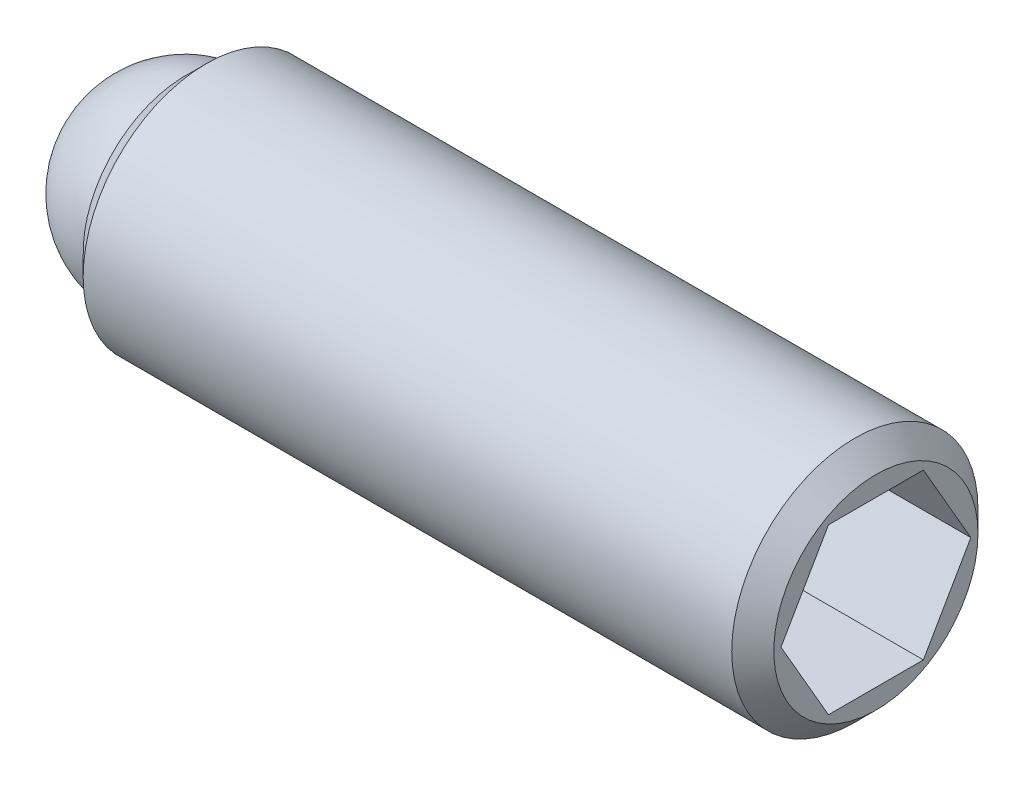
ISO-10303-21;
HEADER;
FILE_DESCRIPTION(('STEP AP214'),'2;1');
FILE_NAME('part.step','',(''),(''),'','','');
FILE_SCHEMA(('AUTOMOTIVE_DESIGN { 1 0 10303 214 1 1 1 1 }'));
ENDSEC;
DATA;
#1=APPLICATION_CONTEXT('core data for automotive mechanical design processes');
#2=APPLICATION_PROTOCOL_DEFINITION('international standard','automotive_design',2000,#1);
#3=PRODUCT_CONTEXT('',#1,'mechanical');
#4=PRODUCT('Part','Part','',(#3));
#5=PRODUCT_RELATED_PRODUCT_CATEGORY('part','',(#4));
#6=PRODUCT_DEFINITION_FORMATION('','',#4);
#7=PRODUCT_DEFINITION_CONTEXT('part definition',#1,'design');
#8=PRODUCT_DEFINITION('design','',#6,#7);
#9=PRODUCT_DEFINITION_SHAPE('','',#8);
#10=(LENGTH_UNIT() NAMED_UNIT(*) SI_UNIT(.MILLI.,.METRE.));
#11=(NAMED_UNIT(*) PLANE_ANGLE_UNIT() SI_UNIT($,.RADIAN.));
#12=(NAMED_UNIT(*) SI_UNIT($,.STERADIAN.) SOLID_ANGLE_UNIT());
#13=UNCERTAINTY_MEASURE_WITH_UNIT(LENGTH_MEASURE(1.E-05),#10,'distance_accuracy_value','');
#14=(GEOMETRIC_REPRESENTATION_CONTEXT(3) GLOBAL_UNCERTAINTY_ASSIGNED_CONTEXT((#13)) GLOBAL_UNIT_ASSIGNED_CONTEXT((#10,
#11,#12)) REPRESENTATION_CONTEXT('',''));
#15=CARTESIAN_POINT('',(0.,0.,0.));
#16=DIRECTION('',(0.,0.,1.));
#17=DIRECTION('',(1.,0.,0.));
#18=AXIS2_PLACEMENT_3D('',#15,#16,#17);
#19=CARTESIAN_POINT('',(0.,0.,0.));
#20=DIRECTION('',(0.,-1.,0.));
#21=DIRECTION('',(0.,0.,-1.));
#22=AXIS2_PLACEMENT_3D('',#19,#20,#21);
#23=SPHERICAL_SURFACE('',#22,1.190625);
#24=CARTESIAN_POINT('',(0.,-1.190625,0.));
#25=VERTEX_POINT('',#24);
#26=VERTEX_LOOP('',#25);
#27=FACE_BOUND('',#26,.T.);
#28=ADVANCED_FACE('F43',(#27),#23,.T.);
#29=CLOSED_SHELL('',(#28));
#30=MANIFOLD_SOLID_BREP('B2',#29);
#31=CARTESIAN_POINT('',(8.334375,0.,0.));
#32=DIRECTION('',(-1.,0.,0.));
#33=DIRECTION('',(0.,0.,1.));
#34=AXIS2_PLACEMENT_3D('',#31,#32,#33);
#35=CYLINDRICAL_SURFACE('',#34,1.4859);
#36=CARTESIAN_POINT('',(8.080375,0.,0.));
#37=DIRECTION('',(1.,0.,0.));
#38=DIRECTION('',(0.,0.,-1.));
#39=AXIS2_PLACEMENT_3D('',#36,#37,#38);
#40=CIRCLE('',#39,1.4859);
#41=CARTESIAN_POINT('',(8.080375,0.,-1.4859));
#42=VERTEX_POINT('',#41);
#43=EDGE_CURVE('E41',#42,#42,#40,.F.);
#44=ORIENTED_EDGE('',*,*,#43,.T.);
#45=EDGE_LOOP('',(#44));
#46=FACE_BOUND('',#45,.T.);
#47=CARTESIAN_POINT('',(0.254000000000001,0.,0.));
#48=DIRECTION('',(1.,0.,0.));
#49=DIRECTION('',(0.,0.,-1.));
#50=AXIS2_PLACEMENT_3D('',#47,#48,#49);
#51=CIRCLE('',#50,1.4859);
#52=CARTESIAN_POINT('',(0.254000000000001,0.,-1.4859));
#53=VERTEX_POINT('',#52);
#54=EDGE_CURVE('E159',#53,#53,#51,.T.);
#55=ORIENTED_EDGE('',*,*,#54,.T.);
#56=EDGE_LOOP('',(#55));
#57=FACE_BOUND('',#56,.T.);
#58=ADVANCED_FACE('F56',(#46,#57),#35,.T.);
#59=CARTESIAN_POINT('',(8.334375,0.,0.));
#60=DIRECTION('',(1.,0.,0.));
#61=DIRECTION('',(0.,0.,-1.));
#62=AXIS2_PLACEMENT_3D('',#59,#60,#61);
#63=PLANE('',#62);
#64=DIRECTION('',(0.,0.866025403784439,-0.5));
#65=VECTOR('',#64,1.);
#66=CARTESIAN_POINT('',(8.334375,-0.992187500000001,-0.572839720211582));
#67=LINE('',#66,#65);
#68=CARTESIAN_POINT('',(8.334375,-0.992187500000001,-0.572839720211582));
#69=VERTEX_POINT('',#68);
#70=CARTESIAN_POINT('',(8.334375,0.,-1.14567944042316));
#71=VERTEX_POINT('',#70);
#72=EDGE_CURVE('E71',#69,#71,#67,.T.);
#73=ORIENTED_EDGE('',*,*,#72,.F.);
#74=DIRECTION('',(0.,0.,-1.));
#75=VECTOR('',#74,1.);
#76=CARTESIAN_POINT('',(8.334375,-0.992187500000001,0.572839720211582));
#77=LINE('',#76,#75);
#78=CARTESIAN_POINT('',(8.334375,-0.992187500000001,0.572839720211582));
#79=VERTEX_POINT('',#78);
#80=EDGE_CURVE('E155',#79,#69,#77,.T.);
#81=ORIENTED_EDGE('',*,*,#80,.F.);
#82=DIRECTION('',(0.,-0.866025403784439,-0.5));
#83=VECTOR('',#82,1.);
#84=CARTESIAN_POINT('',(8.334375,0.,1.14567944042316));
#85=LINE('',#84,#83);
#86=CARTESIAN_POINT('',(8.334375,0.,1.14567944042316));
#87=VERTEX_POINT('',#86);
#88=EDGE_CURVE('E153',#87,#79,#85,.T.);
#89=ORIENTED_EDGE('',*,*,#88,.F.);
#90=DIRECTION('',(0.,-0.866025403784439,0.5));
#91=VECTOR('',#90,1.);
#92=CARTESIAN_POINT('',(8.334375,0.992187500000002,0.572839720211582));
#93=LINE('',#92,#91);
#94=CARTESIAN_POINT('',(8.334375,0.992187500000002,0.572839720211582));
#95=VERTEX_POINT('',#94);
#96=EDGE_CURVE('E119',#95,#87,#93,.T.);
#97=ORIENTED_EDGE('',*,*,#96,.F.);
#98=DIRECTION('',(0.,0.,1.));
#99=VECTOR('',#98,1.);
#100=CARTESIAN_POINT('',(8.334375,0.992187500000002,-0.572839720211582));
#101=LINE('',#100,#99);
#102=CARTESIAN_POINT('',(8.334375,0.992187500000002,-0.572839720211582));
#103=VERTEX_POINT('',#102);
#104=EDGE_CURVE('E149',#103,#95,#101,.T.);
#105=ORIENTED_EDGE('',*,*,#104,.F.);
#106=DIRECTION('',(0.,0.866025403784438,0.5));
#107=VECTOR('',#106,1.);
#108=CARTESIAN_POINT('',(8.334375,0.,-1.14567944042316));
#109=LINE('',#108,#107);
#110=EDGE_CURVE('E145',#71,#103,#109,.T.);
#111=ORIENTED_EDGE('',*,*,#110,.F.);
#112=EDGE_LOOP('',(#73,#81,#89,#97,#105,#111));
#113=FACE_BOUND('',#112,.T.);
#114=CARTESIAN_POINT('',(8.334375,0.,0.));
#115=DIRECTION('',(1.,0.,0.));
#116=DIRECTION('',(0.,0.,-1.));
#117=AXIS2_PLACEMENT_3D('',#114,#115,#116);
#118=CIRCLE('',#117,1.2319);
#119=CARTESIAN_POINT('',(8.334375,0.,-1.2319));
#120=VERTEX_POINT('',#119);
#121=EDGE_CURVE('E64',#120,#120,#118,.T.);
#122=ORIENTED_EDGE('',*,*,#121,.T.);
#123=EDGE_LOOP('',(#122));
#124=FACE_BOUND('',#123,.T.);
#125=ADVANCED_FACE('F172',(#113,#124),#63,.T.);
#126=CARTESIAN_POINT('',(0.,0.,0.));
#127=DIRECTION('',(1.,0.,0.));
#128=DIRECTION('',(0.,0.,-1.));
#129=AXIS2_PLACEMENT_3D('',#126,#127,#128);
#130=PLANE('',#129);
#131=CARTESIAN_POINT('',(0.,0.,0.));
#132=DIRECTION('',(-1.,0.,0.));
#133=DIRECTION('',(0.,0.,1.));
#134=AXIS2_PLACEMENT_3D('',#131,#132,#133);
#135=CIRCLE('',#134,1.190625);
#136=CARTESIAN_POINT('',(0.,0.,1.190625));
#137=VERTEX_POINT('',#136);
#138=EDGE_CURVE('E227',#137,#137,#135,.T.);
#139=ORIENTED_EDGE('',*,*,#138,.F.);
#140=EDGE_LOOP('',(#139));
#141=FACE_BOUND('',#140,.T.);
#142=CARTESIAN_POINT('',(0.,0.,0.));
#143=DIRECTION('',(1.,0.,0.));
#144=DIRECTION('',(0.,0.,-1.));
#145=AXIS2_PLACEMENT_3D('',#142,#143,#144);
#146=CIRCLE('',#145,1.2319);
#147=CARTESIAN_POINT('',(0.,0.,-1.2319));
#148=VERTEX_POINT('',#147);
#149=EDGE_CURVE('E167',#148,#148,#146,.F.);
#150=ORIENTED_EDGE('',*,*,#149,.T.);
#151=EDGE_LOOP('',(#150));
#152=FACE_BOUND('',#151,.T.);
#153=ADVANCED_FACE('F184',(#141,#152),#130,.F.);
#154=CARTESIAN_POINT('',(0.254000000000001,0.,0.));
#155=DIRECTION('',(1.,0.,0.));
#156=DIRECTION('',(0.,0.,-1.));
#157=AXIS2_PLACEMENT_3D('',#154,#155,#156);
#158=CONICAL_SURFACE('',#157,1.4859,0.785398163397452);
#159=ORIENTED_EDGE('',*,*,#149,.F.);
#160=EDGE_LOOP('',(#159));
#161=FACE_BOUND('',#160,.T.);
#162=ORIENTED_EDGE('',*,*,#54,.F.);
#163=EDGE_LOOP('',(#162));
#164=FACE_BOUND('',#163,.T.);
#165=ADVANCED_FACE('F176',(#161,#164),#158,.T.);
#166=CARTESIAN_POINT('',(8.334375,0.,0.));
#167=DIRECTION('',(-1.,0.,0.));
#168=DIRECTION('',(0.,0.,1.));
#169=AXIS2_PLACEMENT_3D('',#166,#167,#168);
#170=CONICAL_SURFACE('',#169,1.2319,0.785398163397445);
#171=ORIENTED_EDGE('',*,*,#43,.F.);
#172=EDGE_LOOP('',(#171));
#173=FACE_BOUND('',#172,.T.);
#174=ORIENTED_EDGE('',*,*,#121,.F.);
#175=EDGE_LOOP('',(#174));
#176=FACE_BOUND('',#175,.T.);
#177=ADVANCED_FACE('F58',(#173,#176),#170,.T.);
#178=CARTESIAN_POINT('',(6.048375,-0.992187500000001,-0.572839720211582));
#179=DIRECTION('',(0.,-0.5,-0.866025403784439));
#180=DIRECTION('',(0.,0.866025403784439,-0.5));
#181=AXIS2_PLACEMENT_3D('',#178,#179,#180);
#182=PLANE('',#181);
#183=ORIENTED_EDGE('',*,*,#72,.T.);
#184=DIRECTION('',(1.,0.,0.));
#185=VECTOR('',#184,1.);
#186=CARTESIAN_POINT('',(6.048375,0.,-1.14567944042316));
#187=LINE('',#186,#185);
#188=CARTESIAN_POINT('',(6.048375,0.,-1.14567944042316));
#189=VERTEX_POINT('',#188);
#190=EDGE_CURVE('E101',#189,#71,#187,.T.);
#191=ORIENTED_EDGE('',*,*,#190,.F.);
#192=DIRECTION('',(0.,0.866025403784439,-0.5));
#193=VECTOR('',#192,1.);
#194=CARTESIAN_POINT('',(6.048375,-0.992187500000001,-0.572839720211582));
#195=LINE('',#194,#193);
#196=CARTESIAN_POINT('',(6.048375,-0.992187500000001,-0.572839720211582));
#197=VERTEX_POINT('',#196);
#198=EDGE_CURVE('E157',#197,#189,#195,.T.);
#199=ORIENTED_EDGE('',*,*,#198,.F.);
#200=DIRECTION('',(1.,0.,0.));
#201=VECTOR('',#200,1.);
#202=CARTESIAN_POINT('',(6.048375,-0.992187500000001,-0.572839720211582));
#203=LINE('',#202,#201);
#204=EDGE_CURVE('E79',#197,#69,#203,.T.);
#205=ORIENTED_EDGE('',*,*,#204,.T.);
#206=EDGE_LOOP('',(#183,#191,#199,#205));
#207=FACE_BOUND('',#206,.T.);
#208=ADVANCED_FACE('F175',(#207),#182,.F.);
#209=CARTESIAN_POINT('',(6.048375,-0.992187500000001,0.572839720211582));
#210=DIRECTION('',(0.,-1.,0.));
#211=DIRECTION('',(0.,0.,-1.));
#212=AXIS2_PLACEMENT_3D('',#209,#210,#211);
#213=PLANE('',#212);
#214=ORIENTED_EDGE('',*,*,#80,.T.);
#215=ORIENTED_EDGE('',*,*,#204,.F.);
#216=DIRECTION('',(0.,0.,-1.));
#217=VECTOR('',#216,1.);
#218=CARTESIAN_POINT('',(6.048375,-0.992187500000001,0.572839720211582));
#219=LINE('',#218,#217);
#220=CARTESIAN_POINT('',(6.048375,-0.992187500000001,0.572839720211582));
#221=VERTEX_POINT('',#220);
#222=EDGE_CURVE('E131',#221,#197,#219,.T.);
#223=ORIENTED_EDGE('',*,*,#222,.F.);
#224=DIRECTION('',(1.,0.,0.));
#225=VECTOR('',#224,1.);
#226=CARTESIAN_POINT('',(6.048375,-0.992187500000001,0.572839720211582));
#227=LINE('',#226,#225);
#228=EDGE_CURVE('E123',#221,#79,#227,.T.);
#229=ORIENTED_EDGE('',*,*,#228,.T.);
#230=EDGE_LOOP('',(#214,#215,#223,#229));
#231=FACE_BOUND('',#230,.T.);
#232=ADVANCED_FACE('F182',(#231),#213,.F.);
#233=CARTESIAN_POINT('',(6.048375,0.,1.14567944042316));
#234=DIRECTION('',(0.,-0.5,0.866025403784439));
#235=DIRECTION('',(0.,-0.866025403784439,-0.5));
#236=AXIS2_PLACEMENT_3D('',#233,#234,#235);
#237=PLANE('',#236);
#238=ORIENTED_EDGE('',*,*,#88,.T.);
#239=ORIENTED_EDGE('',*,*,#228,.F.);
#240=DIRECTION('',(0.,-0.866025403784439,-0.5));
#241=VECTOR('',#240,1.);
#242=CARTESIAN_POINT('',(6.048375,0.,1.14567944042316));
#243=LINE('',#242,#241);
#244=CARTESIAN_POINT('',(6.048375,0.,1.14567944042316));
#245=VERTEX_POINT('',#244);
#246=EDGE_CURVE('E127',#245,#221,#243,.T.);
#247=ORIENTED_EDGE('',*,*,#246,.F.);
#248=DIRECTION('',(1.,0.,0.));
#249=VECTOR('',#248,1.);
#250=CARTESIAN_POINT('',(6.048375,0.,1.14567944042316));
#251=LINE('',#250,#249);
#252=EDGE_CURVE('E112',#245,#87,#251,.T.);
#253=ORIENTED_EDGE('',*,*,#252,.T.);
#254=EDGE_LOOP('',(#238,#239,#247,#253));
#255=FACE_BOUND('',#254,.T.);
#256=ADVANCED_FACE('F128',(#255),#237,.F.);
#257=CARTESIAN_POINT('',(6.048375,0.992187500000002,0.572839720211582));
#258=DIRECTION('',(0.,0.5,0.866025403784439));
#259=DIRECTION('',(0.,-0.866025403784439,0.5));
#260=AXIS2_PLACEMENT_3D('',#257,#258,#259);
#261=PLANE('',#260);
#262=ORIENTED_EDGE('',*,*,#96,.T.);
#263=ORIENTED_EDGE('',*,*,#252,.F.);
#264=DIRECTION('',(0.,-0.866025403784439,0.5));
#265=VECTOR('',#264,1.);
#266=CARTESIAN_POINT('',(6.048375,0.992187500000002,0.572839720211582));
#267=LINE('',#266,#265);
#268=CARTESIAN_POINT('',(6.048375,0.992187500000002,0.572839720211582));
#269=VERTEX_POINT('',#268);
#270=EDGE_CURVE('E116',#269,#245,#267,.T.);
#271=ORIENTED_EDGE('',*,*,#270,.F.);
#272=DIRECTION('',(1.,0.,0.));
#273=VECTOR('',#272,1.);
#274=CARTESIAN_POINT('',(6.048375,0.992187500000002,0.572839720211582));
#275=LINE('',#274,#273);
#276=EDGE_CURVE('E124',#269,#95,#275,.T.);
#277=ORIENTED_EDGE('',*,*,#276,.T.);
#278=EDGE_LOOP('',(#262,#263,#271,#277));
#279=FACE_BOUND('',#278,.T.);
#280=ADVANCED_FACE('F114',(#279),#261,.F.);
#281=CARTESIAN_POINT('',(6.048375,0.992187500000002,-0.572839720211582));
#282=DIRECTION('',(0.,1.,0.));
#283=DIRECTION('',(0.,0.,1.));
#284=AXIS2_PLACEMENT_3D('',#281,#282,#283);
#285=PLANE('',#284);
#286=ORIENTED_EDGE('',*,*,#104,.T.);
#287=ORIENTED_EDGE('',*,*,#276,.F.);
#288=DIRECTION('',(0.,0.,1.));
#289=VECTOR('',#288,1.);
#290=CARTESIAN_POINT('',(6.048375,0.992187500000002,-0.572839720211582));
#291=LINE('',#290,#289);
#292=CARTESIAN_POINT('',(6.048375,0.992187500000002,-0.572839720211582));
#293=VERTEX_POINT('',#292);
#294=EDGE_CURVE('E137',#293,#269,#291,.T.);
#295=ORIENTED_EDGE('',*,*,#294,.F.);
#296=DIRECTION('',(1.,0.,0.));
#297=VECTOR('',#296,1.);
#298=CARTESIAN_POINT('',(6.048375,0.992187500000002,-0.572839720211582));
#299=LINE('',#298,#297);
#300=EDGE_CURVE('E162',#293,#103,#299,.T.);
#301=ORIENTED_EDGE('',*,*,#300,.T.);
#302=EDGE_LOOP('',(#286,#287,#295,#301));
#303=FACE_BOUND('',#302,.T.);
#304=ADVANCED_FACE('F203',(#303),#285,.F.);
#305=CARTESIAN_POINT('',(6.048375,0.,-1.14567944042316));
#306=DIRECTION('',(0.,0.5,-0.866025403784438));
#307=DIRECTION('',(0.,0.866025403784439,0.5));
#308=AXIS2_PLACEMENT_3D('',#305,#306,#307);
#309=PLANE('',#308);
#310=ORIENTED_EDGE('',*,*,#110,.T.);
#311=ORIENTED_EDGE('',*,*,#300,.F.);
#312=DIRECTION('',(0.,0.866025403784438,0.5));
#313=VECTOR('',#312,1.);
#314=CARTESIAN_POINT('',(6.048375,0.,-1.14567944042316));
#315=LINE('',#314,#313);
#316=EDGE_CURVE('E139',#189,#293,#315,.T.);
#317=ORIENTED_EDGE('',*,*,#316,.F.);
#318=ORIENTED_EDGE('',*,*,#190,.T.);
#319=EDGE_LOOP('',(#310,#311,#317,#318));
#320=FACE_BOUND('',#319,.T.);
#321=ADVANCED_FACE('F200',(#320),#309,.F.);
#322=CARTESIAN_POINT('',(6.048375,0.,0.));
#323=DIRECTION('',(1.,0.,0.));
#324=DIRECTION('',(0.,0.,-1.));
#325=AXIS2_PLACEMENT_3D('',#322,#323,#324);
#326=PLANE('',#325);
#327=ORIENTED_EDGE('',*,*,#198,.T.);
#328=ORIENTED_EDGE('',*,*,#316,.T.);
#329=ORIENTED_EDGE('',*,*,#294,.T.);
#330=ORIENTED_EDGE('',*,*,#270,.T.);
#331=ORIENTED_EDGE('',*,*,#246,.T.);
#332=ORIENTED_EDGE('',*,*,#222,.T.);
#333=EDGE_LOOP('',(#327,#328,#329,#330,#331,#332));
#334=FACE_BOUND('',#333,.T.);
#335=ADVANCED_FACE('F134',(#334),#326,.T.);
#336=CARTESIAN_POINT('',(1.190625,0.,0.));
#337=DIRECTION('',(-1.,0.,0.));
#338=DIRECTION('',(0.,0.,1.));
#339=AXIS2_PLACEMENT_3D('',#336,#337,#338);
#340=CYLINDRICAL_SURFACE('',#339,1.190625);
#341=CARTESIAN_POINT('',(1.190625,0.,0.));
#342=DIRECTION('',(-1.,0.,0.));
#343=DIRECTION('',(0.,0.,1.));
#344=AXIS2_PLACEMENT_3D('',#341,#342,#343);
#345=CIRCLE('',#344,1.190625);
#346=CARTESIAN_POINT('',(1.190625,0.,1.190625));
#347=VERTEX_POINT('',#346);
#348=EDGE_CURVE('E146',#347,#347,#345,.T.);
#349=CARTESIAN_POINT('',(1.190625,0.,1.190625));
#350=CARTESIAN_POINT('',(1.17822265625,0.,1.190625));
#351=CARTESIAN_POINT('',(1.1658203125,0.,1.190625));
#352=CARTESIAN_POINT('',(1.141015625,0.,1.190625));
#353=CARTESIAN_POINT('',(1.12861328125,0.,1.190625));
#354=CARTESIAN_POINT('',(1.10380859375,0.,1.190625));
#355=CARTESIAN_POINT('',(1.09140625,0.,1.190625));
#356=CARTESIAN_POINT('',(1.0666015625,0.,1.190625));
#357=CARTESIAN_POINT('',(1.05419921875,0.,1.190625));
#358=CARTESIAN_POINT('',(1.02939453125,0.,1.190625));
#359=CARTESIAN_POINT('',(1.0169921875,0.,1.190625));
#360=CARTESIAN_POINT('',(0.9921875,0.,1.190625));
#361=CARTESIAN_POINT('',(0.97978515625,0.,1.190625));
#362=CARTESIAN_POINT('',(0.95498046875,0.,1.190625));
#363=CARTESIAN_POINT('',(0.942578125,0.,1.190625));
#364=CARTESIAN_POINT('',(0.9177734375,0.,1.190625));
#365=CARTESIAN_POINT('',(0.90537109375,0.,1.190625));
#366=CARTESIAN_POINT('',(0.88056640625,0.,1.190625));
#367=CARTESIAN_POINT('',(0.8681640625,0.,1.190625));
#368=CARTESIAN_POINT('',(0.843359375,0.,1.190625));
#369=CARTESIAN_POINT('',(0.83095703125,0.,1.190625));
#370=CARTESIAN_POINT('',(0.80615234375,0.,1.190625));
#371=CARTESIAN_POINT('',(0.79375,0.,1.190625));
#372=CARTESIAN_POINT('',(0.7689453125,0.,1.190625));
#373=CARTESIAN_POINT('',(0.75654296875,0.,1.190625));
#374=CARTESIAN_POINT('',(0.73173828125,0.,1.190625));
#375=CARTESIAN_POINT('',(0.7193359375,0.,1.190625));
#376=CARTESIAN_POINT('',(0.69453125,0.,1.190625));
#377=CARTESIAN_POINT('',(0.68212890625,0.,1.190625));
#378=CARTESIAN_POINT('',(0.65732421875,0.,1.190625));
#379=CARTESIAN_POINT('',(0.644921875,0.,1.190625));
#380=CARTESIAN_POINT('',(0.6201171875,0.,1.190625));
#381=CARTESIAN_POINT('',(0.60771484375,0.,1.190625));
#382=CARTESIAN_POINT('',(0.58291015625,0.,1.190625));
#383=CARTESIAN_POINT('',(0.5705078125,0.,1.190625));
#384=CARTESIAN_POINT('',(0.545703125,0.,1.190625));
#385=CARTESIAN_POINT('',(0.53330078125,0.,1.190625));
#386=CARTESIAN_POINT('',(0.50849609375,0.,1.190625));
#387=CARTESIAN_POINT('',(0.49609375,0.,1.190625));
#388=CARTESIAN_POINT('',(0.4712890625,0.,1.190625));
#389=CARTESIAN_POINT('',(0.45888671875,0.,1.190625));
#390=CARTESIAN_POINT('',(0.43408203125,0.,1.190625));
#391=CARTESIAN_POINT('',(0.4216796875,0.,1.190625));
#392=CARTESIAN_POINT('',(0.396875,0.,1.190625));
#393=CARTESIAN_POINT('',(0.38447265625,0.,1.190625));
#394=CARTESIAN_POINT('',(0.35966796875,0.,1.190625));
#395=CARTESIAN_POINT('',(0.347265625,0.,1.190625));
#396=CARTESIAN_POINT('',(0.3224609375,0.,1.190625));
#397=CARTESIAN_POINT('',(0.31005859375,0.,1.190625));
#398=CARTESIAN_POINT('',(0.28525390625,0.,1.190625));
#399=CARTESIAN_POINT('',(0.2728515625,0.,1.190625));
#400=CARTESIAN_POINT('',(0.248046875,0.,1.190625));
#401=CARTESIAN_POINT('',(0.23564453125,0.,1.190625));
#402=CARTESIAN_POINT('',(0.21083984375,0.,1.190625));
#403=CARTESIAN_POINT('',(0.1984375,0.,1.190625));
#404=CARTESIAN_POINT('',(0.1736328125,0.,1.190625));
#405=CARTESIAN_POINT('',(0.16123046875,0.,1.190625));
#406=CARTESIAN_POINT('',(0.13642578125,0.,1.190625));
#407=CARTESIAN_POINT('',(0.1240234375,0.,1.190625));
#408=CARTESIAN_POINT('',(0.0992187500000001,0.,1.190625));
#409=CARTESIAN_POINT('',(0.08681640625,0.,1.190625));
#410=CARTESIAN_POINT('',(0.06201171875,0.,1.190625));
#411=CARTESIAN_POINT('',(0.049609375,0.,1.190625));
#412=CARTESIAN_POINT('',(0.0248046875,0.,1.190625));
#413=CARTESIAN_POINT('',(0.01240234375,0.,1.190625));
#414=CARTESIAN_POINT('',(0.,0.,1.190625));
#415=B_SPLINE_CURVE_WITH_KNOTS('',3,(#349,#350,#351,#352,#353,#354,#355,#356,#357,#358,#359,
#360,#361,#362,#363,#364,#365,#366,#367,#368,#369,#370,#371,#372,#373,#374,#375,#376,#377,#378,
#379,#380,#381,#382,#383,#384,#385,#386,#387,#388,#389,#390,#391,#392,#393,#394,#395,#396,#397,
#398,#399,#400,#401,#402,#403,#404,#405,#406,#407,#408,#409,#410,#411,#412,#413,#414),
.UNSPECIFIED.,.F.,.F.,(4,2,2,2,2,2,2,2,2,2,2,2,2,2,2,2,2,2,2,2,2,2,2,2,2,2,2,2,2,2,2,2,4),(0.,
0.03720703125,0.0744140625,0.11162109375,0.148828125,0.18603515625,0.2232421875,0.26044921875,
0.29765625,0.33486328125,0.3720703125,0.40927734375,0.446484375,0.48369140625,0.5208984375,
0.55810546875,0.5953125,0.63251953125,0.6697265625,0.70693359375,0.744140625,0.78134765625,
0.8185546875,0.85576171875,0.89296875,0.93017578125,0.9673828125,1.00458984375,1.041796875,
1.07900390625,1.1162109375,1.15341796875,1.190625),.UNSPECIFIED.);
#416=EDGE_CURVE('BSEAM216',#347,#137,#415,.T.);
#417=ORIENTED_EDGE('',*,*,#348,.F.);
#418=ORIENTED_EDGE('',*,*,#138,.T.);
#419=ORIENTED_EDGE('',*,*,#416,.T.);
#420=ORIENTED_EDGE('',*,*,#416,.F.);
#421=EDGE_LOOP('',(#417,#419,#418,#420));
#422=FACE_BOUND('',#421,.T.);
#423=ADVANCED_FACE('F216',(#422),#340,.F.);
#424=CARTESIAN_POINT('',(1.190625,0.,0.));
#425=DIRECTION('',(-1.,0.,0.));
#426=DIRECTION('',(0.,0.,1.));
#427=AXIS2_PLACEMENT_3D('',#424,#425,#426);
#428=PLANE('',#427);
#429=ORIENTED_EDGE('',*,*,#348,.T.);
#430=EDGE_LOOP('',(#429));
#431=FACE_BOUND('',#430,.T.);
#432=ADVANCED_FACE('F219',(#431),#428,.T.);
#433=CLOSED_SHELL('',(#58,#125,#153,#165,#177,#208,#232,#256,#280,#304,#321,#335,#423,#432));
#434=MANIFOLD_SOLID_BREP('B6',#433);
#435=ADVANCED_BREP_SHAPE_REPRESENTATION('',(#18,#30,#434),#14);
#436=SHAPE_DEFINITION_REPRESENTATION(#9,#435);
ENDSEC;
END-ISO-10303-21;
